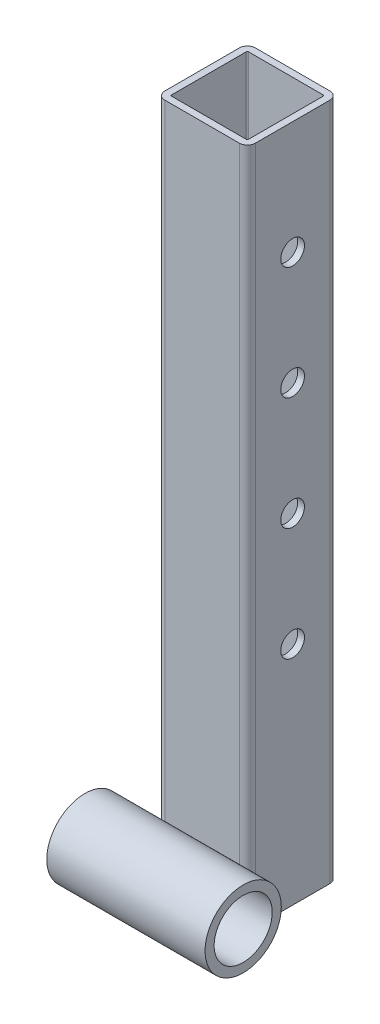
from build123d import *

# Parameters (mm, degrees)
EL_MENT_M_CANO_SOUD_1_DEPTH = 300
BOSS_EXTRU_1_DEPTH          = 35
BOSS_EXTRU_1_DEPTH_BACK     = 35
ESQUISSE3_R                 = 16.85
ESQUISSE3_R_2               = 12.85
ESQUISSE4_R                 = 5.25
ENL_V_MAT_EXTRU_1_DEPTH     = 3


with BuildPart() as part:
    # Sketch1 → El_ment m_cano-soud_1 (new body)
    with BuildSketch(Plane(origin=(0, 0, 0), x_dir=(-1, 0, 0), z_dir=(0, 1, 0))):
        with BuildLine():
            Line((-16.5, -20), (16.5, -20))
            ThreePointArc((16.5, -20), (18.974873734, -18.974873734), (20, -16.5))
            Line((20, -16.5), (20, 16.5))
            ThreePointArc((20, 16.5), (18.974873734, 18.974873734), (16.5, 20))
            Line((16.5, 20), (-16.5, 20))
            ThreePointArc((-16.5, 20), (-18.974873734, 18.974873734), (-20, 16.5))
            Line((-20, 16.5), (-20, -16.5))
            ThreePointArc((-20, -16.5), (-18.974873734, -18.974873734), (-16.5, -20))
        make_face()
        with BuildLine():
            Line((-16.5, -17), (16.5, -17))
            ThreePointArc((16.5, -17), (16.853553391, -16.853553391), (17, -16.5))
            Line((17, -16.5), (17, 16.5))
            ThreePointArc((17, 16.5), (16.853553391, 16.853553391), (16.5, 17))
            Line((16.5, 17), (-16.5, 17))
            ThreePointArc((-16.5, 17), (-16.853553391, 16.853553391), (-17, 16.5))
            Line((-17, 16.5), (-17, -16.5))
            ThreePointArc((-17, -16.5), (-16.853553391, -16.853553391), (-16.5, -17))
        make_face(mode=Mode.SUBTRACT)
    extrude(amount=EL_MENT_M_CANO_SOUD_1_DEPTH)

    # Esquisse4 → Enl_v. mat.-Extru.1 (cut)
    with BuildSketch(Plane(origin=(20, 0, 0), x_dir=(0, 0, -1), z_dir=(1, 0, 0))):
        with Locations((0, 250)):
            Circle(ESQUISSE4_R)
        with Locations((0, 200)):
            Circle(ESQUISSE4_R)
        with Locations((0, 150)):
            Circle(ESQUISSE4_R)
        with Locations((0, 100)):
            Circle(ESQUISSE4_R)
    extrude(amount=-ENL_V_MAT_EXTRU_1_DEPTH, mode=Mode.SUBTRACT)


with BuildPart() as body_2:
    # Esquisse3 → Boss.-Extru.1 (new, two sides: drawn at the far end of the back side and taken through both)
    with BuildSketch(Plane(origin=(0, 0, 0), x_dir=(0, 0, -1), z_dir=(1, 0, 0)).offset(-BOSS_EXTRU_1_DEPTH_BACK)):
        with Locations((-36.85, 16.85)):
            Circle(ESQUISSE3_R)
        with Locations((-36.85, 16.85)):
            Circle(ESQUISSE3_R_2, mode=Mode.SUBTRACT)
    extrude(amount=BOSS_EXTRU_1_DEPTH + BOSS_EXTRU_1_DEPTH_BACK)


solid = Compound([part.part, body_2.part])
